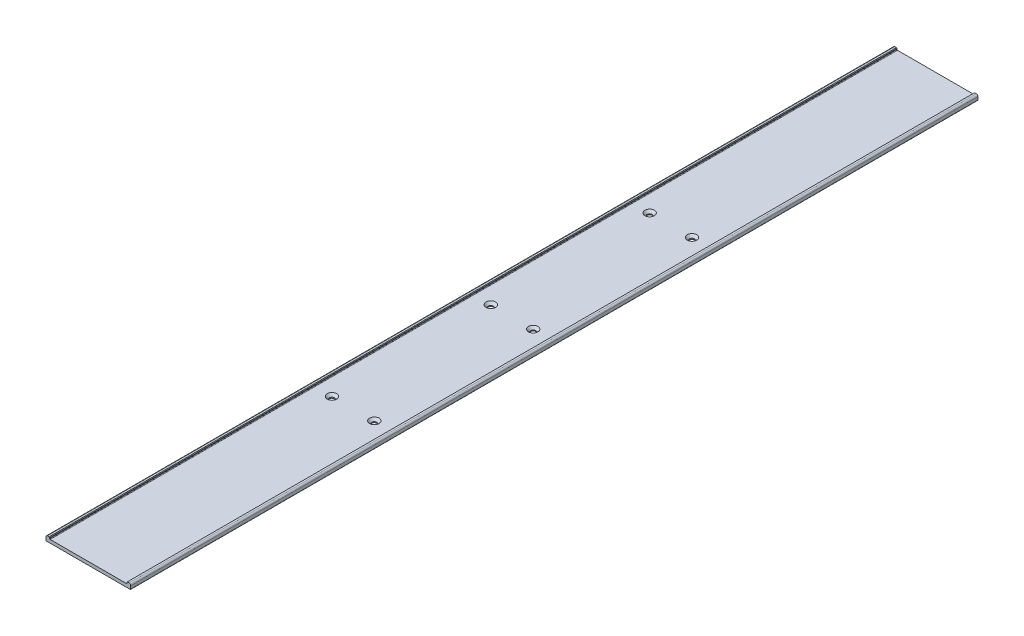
ISO-10303-21;
HEADER;
FILE_DESCRIPTION(('STEP AP214'),'2;1');
FILE_NAME('part.step','',(''),(''),'','','');
FILE_SCHEMA(('AUTOMOTIVE_DESIGN { 1 0 10303 214 1 1 1 1 }'));
ENDSEC;
DATA;
#1=APPLICATION_CONTEXT('core data for automotive mechanical design processes');
#2=APPLICATION_PROTOCOL_DEFINITION('international standard','automotive_design',2000,#1);
#3=PRODUCT_CONTEXT('',#1,'mechanical');
#4=PRODUCT('Part','Part','',(#3));
#5=PRODUCT_RELATED_PRODUCT_CATEGORY('part','',(#4));
#6=PRODUCT_DEFINITION_FORMATION('','',#4);
#7=PRODUCT_DEFINITION_CONTEXT('part definition',#1,'design');
#8=PRODUCT_DEFINITION('design','',#6,#7);
#9=PRODUCT_DEFINITION_SHAPE('','',#8);
#10=(LENGTH_UNIT() NAMED_UNIT(*) SI_UNIT(.MILLI.,.METRE.));
#11=(NAMED_UNIT(*) PLANE_ANGLE_UNIT() SI_UNIT($,.RADIAN.));
#12=(NAMED_UNIT(*) SI_UNIT($,.STERADIAN.) SOLID_ANGLE_UNIT());
#13=UNCERTAINTY_MEASURE_WITH_UNIT(LENGTH_MEASURE(1.E-05),#10,'distance_accuracy_value','');
#14=(GEOMETRIC_REPRESENTATION_CONTEXT(3) GLOBAL_UNCERTAINTY_ASSIGNED_CONTEXT((#13)) GLOBAL_UNIT_ASSIGNED_CONTEXT((#10,
#11,#12)) REPRESENTATION_CONTEXT('',''));
#15=CARTESIAN_POINT('',(0.,0.,0.));
#16=DIRECTION('',(0.,0.,1.));
#17=DIRECTION('',(1.,0.,0.));
#18=AXIS2_PLACEMENT_3D('',#15,#16,#17);
#19=CARTESIAN_POINT('',(79.5,0.5,-400.));
#20=DIRECTION('',(0.,0.,1.));
#21=DIRECTION('',(1.,0.,0.));
#22=AXIS2_PLACEMENT_3D('',#19,#20,#21);
#23=CYLINDRICAL_SURFACE('',#22,0.5);
#24=CARTESIAN_POINT('',(79.5,0.5,400.));
#25=DIRECTION('',(0.,0.,1.));
#26=DIRECTION('',(1.,0.,0.));
#27=AXIS2_PLACEMENT_3D('',#24,#25,#26);
#28=CIRCLE('',#27,0.5);
#29=CARTESIAN_POINT('',(79.5,0.,400.));
#30=VERTEX_POINT('',#29);
#31=CARTESIAN_POINT('',(80.,0.5,400.));
#32=VERTEX_POINT('',#31);
#33=EDGE_CURVE('E187',#30,#32,#28,.T.);
#34=ORIENTED_EDGE('',*,*,#33,.F.);
#35=DIRECTION('',(0.,0.,1.));
#36=VECTOR('',#35,1.);
#37=CARTESIAN_POINT('',(79.5,0.,-400.));
#38=LINE('',#37,#36);
#39=CARTESIAN_POINT('',(79.5,0.,-400.));
#40=VERTEX_POINT('',#39);
#41=EDGE_CURVE('E11',#40,#30,#38,.T.);
#42=ORIENTED_EDGE('',*,*,#41,.F.);
#43=CARTESIAN_POINT('',(79.5,0.5,-400.));
#44=DIRECTION('',(0.,0.,1.));
#45=DIRECTION('',(1.,0.,0.));
#46=AXIS2_PLACEMENT_3D('',#43,#44,#45);
#47=CIRCLE('',#46,0.5);
#48=CARTESIAN_POINT('',(80.,0.5,-400.));
#49=VERTEX_POINT('',#48);
#50=EDGE_CURVE('E232',#40,#49,#47,.T.);
#51=ORIENTED_EDGE('',*,*,#50,.T.);
#52=DIRECTION('',(0.,0.,1.));
#53=VECTOR('',#52,1.);
#54=CARTESIAN_POINT('',(80.,0.5,-400.));
#55=LINE('',#54,#53);
#56=EDGE_CURVE('E121',#49,#32,#55,.T.);
#57=ORIENTED_EDGE('',*,*,#56,.T.);
#58=EDGE_LOOP('',(#34,#42,#51,#57));
#59=FACE_BOUND('',#58,.T.);
#60=ADVANCED_FACE('F41',(#59),#23,.T.);
#61=CARTESIAN_POINT('',(0.500000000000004,0.,-400.));
#62=DIRECTION('',(0.,-1.,0.));
#63=DIRECTION('',(0.,0.,-1.));
#64=AXIS2_PLACEMENT_3D('',#61,#62,#63);
#65=PLANE('',#64);
#66=CARTESIAN_POINT('',(60.,0.,-150.));
#67=DIRECTION('',(0.,-1.,0.));
#68=DIRECTION('',(0.,0.,-1.));
#69=AXIS2_PLACEMENT_3D('',#66,#67,#68);
#70=CIRCLE('',#69,2.24999999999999);
#71=CARTESIAN_POINT('',(60.,0.,-152.25));
#72=VERTEX_POINT('',#71);
#73=EDGE_CURVE('E44',#72,#72,#70,.T.);
#74=ORIENTED_EDGE('',*,*,#73,.F.);
#75=EDGE_LOOP('',(#74));
#76=FACE_BOUND('',#75,.T.);
#77=CARTESIAN_POINT('',(60.,0.,150.));
#78=DIRECTION('',(0.,-1.,0.));
#79=DIRECTION('',(0.,0.,-1.));
#80=AXIS2_PLACEMENT_3D('',#77,#78,#79);
#81=CIRCLE('',#80,2.24999999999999);
#82=CARTESIAN_POINT('',(60.,0.,147.75));
#83=VERTEX_POINT('',#82);
#84=EDGE_CURVE('E276',#83,#83,#81,.T.);
#85=ORIENTED_EDGE('',*,*,#84,.F.);
#86=EDGE_LOOP('',(#85));
#87=FACE_BOUND('',#86,.T.);
#88=CARTESIAN_POINT('',(60.,0.,0.));
#89=DIRECTION('',(0.,-1.,0.));
#90=DIRECTION('',(0.,0.,-1.));
#91=AXIS2_PLACEMENT_3D('',#88,#89,#90);
#92=CIRCLE('',#91,2.24999999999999);
#93=CARTESIAN_POINT('',(60.,0.,-2.24999999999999));
#94=VERTEX_POINT('',#93);
#95=EDGE_CURVE('E272',#94,#94,#92,.T.);
#96=ORIENTED_EDGE('',*,*,#95,.F.);
#97=EDGE_LOOP('',(#96));
#98=FACE_BOUND('',#97,.T.);
#99=CARTESIAN_POINT('',(20.,0.,-150.));
#100=DIRECTION('',(0.,-1.,0.));
#101=DIRECTION('',(0.,0.,-1.));
#102=AXIS2_PLACEMENT_3D('',#99,#100,#101);
#103=CIRCLE('',#102,2.24999999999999);
#104=CARTESIAN_POINT('',(20.,0.,-152.25));
#105=VERTEX_POINT('',#104);
#106=EDGE_CURVE('E267',#105,#105,#103,.T.);
#107=ORIENTED_EDGE('',*,*,#106,.F.);
#108=EDGE_LOOP('',(#107));
#109=FACE_BOUND('',#108,.T.);
#110=CARTESIAN_POINT('',(20.,0.,150.));
#111=DIRECTION('',(0.,-1.,0.));
#112=DIRECTION('',(0.,0.,-1.));
#113=AXIS2_PLACEMENT_3D('',#110,#111,#112);
#114=CIRCLE('',#113,2.24999999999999);
#115=CARTESIAN_POINT('',(20.,0.,147.75));
#116=VERTEX_POINT('',#115);
#117=EDGE_CURVE('E262',#116,#116,#114,.T.);
#118=ORIENTED_EDGE('',*,*,#117,.F.);
#119=EDGE_LOOP('',(#118));
#120=FACE_BOUND('',#119,.T.);
#121=CARTESIAN_POINT('',(20.,0.,0.));
#122=DIRECTION('',(0.,-1.,0.));
#123=DIRECTION('',(0.,0.,-1.));
#124=AXIS2_PLACEMENT_3D('',#121,#122,#123);
#125=CIRCLE('',#124,2.24999999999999);
#126=CARTESIAN_POINT('',(20.,0.,-2.24999999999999));
#127=VERTEX_POINT('',#126);
#128=EDGE_CURVE('E191',#127,#127,#125,.T.);
#129=ORIENTED_EDGE('',*,*,#128,.F.);
#130=EDGE_LOOP('',(#129));
#131=FACE_BOUND('',#130,.T.);
#132=DIRECTION('',(1.,0.,0.));
#133=VECTOR('',#132,1.);
#134=CARTESIAN_POINT('',(0.500000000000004,0.,400.));
#135=LINE('',#134,#133);
#136=CARTESIAN_POINT('',(0.500000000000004,0.,400.));
#137=VERTEX_POINT('',#136);
#138=EDGE_CURVE('E230',#137,#30,#135,.T.);
#139=ORIENTED_EDGE('',*,*,#138,.F.);
#140=DIRECTION('',(0.,0.,1.));
#141=VECTOR('',#140,1.);
#142=CARTESIAN_POINT('',(0.500000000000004,0.,-400.));
#143=LINE('',#142,#141);
#144=CARTESIAN_POINT('',(0.500000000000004,0.,-400.));
#145=VERTEX_POINT('',#144);
#146=EDGE_CURVE('E50',#145,#137,#143,.T.);
#147=ORIENTED_EDGE('',*,*,#146,.F.);
#148=DIRECTION('',(1.,0.,0.));
#149=VECTOR('',#148,1.);
#150=CARTESIAN_POINT('',(0.500000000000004,0.,-400.));
#151=LINE('',#150,#149);
#152=EDGE_CURVE('E177',#145,#40,#151,.T.);
#153=ORIENTED_EDGE('',*,*,#152,.T.);
#154=ORIENTED_EDGE('',*,*,#41,.T.);
#155=EDGE_LOOP('',(#139,#147,#153,#154));
#156=FACE_BOUND('',#155,.T.);
#157=ADVANCED_FACE('F381',(#76,#87,#98,#109,#120,#131,#156),#65,.T.);
#158=CARTESIAN_POINT('',(0.5,0.5,-400.));
#159=DIRECTION('',(0.,0.,1.));
#160=DIRECTION('',(1.,0.,0.));
#161=AXIS2_PLACEMENT_3D('',#158,#159,#160);
#162=CYLINDRICAL_SURFACE('',#161,0.5);
#163=CARTESIAN_POINT('',(0.5,0.5,400.));
#164=DIRECTION('',(0.,0.,1.));
#165=DIRECTION('',(1.,0.,0.));
#166=AXIS2_PLACEMENT_3D('',#163,#164,#165);
#167=CIRCLE('',#166,0.5);
#168=CARTESIAN_POINT('',(0.,0.500000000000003,400.));
#169=VERTEX_POINT('',#168);
#170=EDGE_CURVE('E164',#169,#137,#167,.T.);
#171=ORIENTED_EDGE('',*,*,#170,.F.);
#172=DIRECTION('',(0.,0.,1.));
#173=VECTOR('',#172,1.);
#174=CARTESIAN_POINT('',(0.,0.500000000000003,-400.));
#175=LINE('',#174,#173);
#176=CARTESIAN_POINT('',(0.,0.500000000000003,-400.));
#177=VERTEX_POINT('',#176);
#178=EDGE_CURVE('E159',#177,#169,#175,.T.);
#179=ORIENTED_EDGE('',*,*,#178,.F.);
#180=CARTESIAN_POINT('',(0.5,0.5,-400.));
#181=DIRECTION('',(0.,0.,1.));
#182=DIRECTION('',(1.,0.,0.));
#183=AXIS2_PLACEMENT_3D('',#180,#181,#182);
#184=CIRCLE('',#183,0.5);
#185=EDGE_CURVE('E162',#177,#145,#184,.T.);
#186=ORIENTED_EDGE('',*,*,#185,.T.);
#187=ORIENTED_EDGE('',*,*,#146,.T.);
#188=EDGE_LOOP('',(#171,#179,#186,#187));
#189=FACE_BOUND('',#188,.T.);
#190=ADVANCED_FACE('F161',(#189),#162,.T.);
#191=CARTESIAN_POINT('',(0.,0.500000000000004,-400.));
#192=DIRECTION('',(-1.,0.,0.));
#193=DIRECTION('',(0.,0.,1.));
#194=AXIS2_PLACEMENT_3D('',#191,#192,#193);
#195=PLANE('',#194);
#196=DIRECTION('',(0.,-1.,0.));
#197=VECTOR('',#196,1.);
#198=CARTESIAN_POINT('',(0.,0.500000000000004,400.));
#199=LINE('',#198,#197);
#200=CARTESIAN_POINT('',(0.,3.3,400.));
#201=VERTEX_POINT('',#200);
#202=EDGE_CURVE('E227',#201,#169,#199,.T.);
#203=ORIENTED_EDGE('',*,*,#202,.F.);
#204=DIRECTION('',(0.,0.,1.));
#205=VECTOR('',#204,1.);
#206=CARTESIAN_POINT('',(0.,3.3,-400.));
#207=LINE('',#206,#205);
#208=CARTESIAN_POINT('',(0.,3.3,-400.));
#209=VERTEX_POINT('',#208);
#210=EDGE_CURVE('E169',#209,#201,#207,.T.);
#211=ORIENTED_EDGE('',*,*,#210,.F.);
#212=DIRECTION('',(0.,-1.,0.));
#213=VECTOR('',#212,1.);
#214=CARTESIAN_POINT('',(0.,0.500000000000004,-400.));
#215=LINE('',#214,#213);
#216=EDGE_CURVE('E175',#209,#177,#215,.T.);
#217=ORIENTED_EDGE('',*,*,#216,.T.);
#218=ORIENTED_EDGE('',*,*,#178,.T.);
#219=EDGE_LOOP('',(#203,#211,#217,#218));
#220=FACE_BOUND('',#219,.T.);
#221=ADVANCED_FACE('F179',(#220),#195,.T.);
#222=CARTESIAN_POINT('',(1.5,3.3,-400.));
#223=DIRECTION('',(0.,0.,1.));
#224=DIRECTION('',(1.,0.,0.));
#225=AXIS2_PLACEMENT_3D('',#222,#223,#224);
#226=CYLINDRICAL_SURFACE('',#225,1.5);
#227=CARTESIAN_POINT('',(1.5,3.3,400.));
#228=DIRECTION('',(0.,0.,1.));
#229=DIRECTION('',(-1.,0.,0.));
#230=AXIS2_PLACEMENT_3D('',#227,#228,#229);
#231=CIRCLE('',#230,1.5);
#232=CARTESIAN_POINT('',(1.5,4.8,400.));
#233=VERTEX_POINT('',#232);
#234=EDGE_CURVE('E224',#233,#201,#231,.T.);
#235=ORIENTED_EDGE('',*,*,#234,.F.);
#236=DIRECTION('',(0.,0.,1.));
#237=VECTOR('',#236,1.);
#238=CARTESIAN_POINT('',(1.5,4.8,-400.));
#239=LINE('',#238,#237);
#240=CARTESIAN_POINT('',(1.5,4.8,-400.));
#241=VERTEX_POINT('',#240);
#242=EDGE_CURVE('E236',#241,#233,#239,.T.);
#243=ORIENTED_EDGE('',*,*,#242,.F.);
#244=CARTESIAN_POINT('',(1.5,3.3,-400.));
#245=DIRECTION('',(0.,0.,1.));
#246=DIRECTION('',(-1.,0.,0.));
#247=AXIS2_PLACEMENT_3D('',#244,#245,#246);
#248=CIRCLE('',#247,1.5);
#249=EDGE_CURVE('E180',#241,#209,#248,.T.);
#250=ORIENTED_EDGE('',*,*,#249,.T.);
#251=ORIENTED_EDGE('',*,*,#210,.T.);
#252=EDGE_LOOP('',(#235,#243,#250,#251));
#253=FACE_BOUND('',#252,.T.);
#254=ADVANCED_FACE('F399',(#253),#226,.T.);
#255=CARTESIAN_POINT('',(1.5,4.8,-400.));
#256=DIRECTION('',(0.,1.,0.));
#257=DIRECTION('',(-1.,0.,0.));
#258=AXIS2_PLACEMENT_3D('',#255,#256,#257);
#259=PLANE('',#258);
#260=DIRECTION('',(-1.,0.,0.));
#261=VECTOR('',#260,1.);
#262=CARTESIAN_POINT('',(1.5,4.8,400.));
#263=LINE('',#262,#261);
#264=CARTESIAN_POINT('',(3.,4.8,400.));
#265=VERTEX_POINT('',#264);
#266=EDGE_CURVE('E221',#265,#233,#263,.T.);
#267=ORIENTED_EDGE('',*,*,#266,.F.);
#268=DIRECTION('',(0.,0.,1.));
#269=VECTOR('',#268,1.);
#270=CARTESIAN_POINT('',(3.,4.8,-400.));
#271=LINE('',#270,#269);
#272=CARTESIAN_POINT('',(3.,4.8,-400.));
#273=VERTEX_POINT('',#272);
#274=EDGE_CURVE('E238',#273,#265,#271,.T.);
#275=ORIENTED_EDGE('',*,*,#274,.F.);
#276=DIRECTION('',(-1.,0.,0.));
#277=VECTOR('',#276,1.);
#278=CARTESIAN_POINT('',(1.5,4.8,-400.));
#279=LINE('',#278,#277);
#280=EDGE_CURVE('E182',#273,#241,#279,.T.);
#281=ORIENTED_EDGE('',*,*,#280,.T.);
#282=ORIENTED_EDGE('',*,*,#242,.T.);
#283=EDGE_LOOP('',(#267,#275,#281,#282));
#284=FACE_BOUND('',#283,.T.);
#285=ADVANCED_FACE('F340',(#284),#259,.T.);
#286=CARTESIAN_POINT('',(3.,4.8,-400.));
#287=DIRECTION('',(0.707106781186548,0.707106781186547,0.));
#288=DIRECTION('',(-0.707106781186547,0.707106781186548,0.));
#289=AXIS2_PLACEMENT_3D('',#286,#287,#288);
#290=PLANE('',#289);
#291=DIRECTION('',(-0.707106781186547,0.707106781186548,0.));
#292=VECTOR('',#291,1.);
#293=CARTESIAN_POINT('',(3.,4.8,400.));
#294=LINE('',#293,#292);
#295=CARTESIAN_POINT('',(3.5,4.3,400.));
#296=VERTEX_POINT('',#295);
#297=EDGE_CURVE('E218',#296,#265,#294,.T.);
#298=ORIENTED_EDGE('',*,*,#297,.F.);
#299=DIRECTION('',(0.,0.,1.));
#300=VECTOR('',#299,1.);
#301=CARTESIAN_POINT('',(3.5,4.3,-400.));
#302=LINE('',#301,#300);
#303=CARTESIAN_POINT('',(3.5,4.3,-400.));
#304=VERTEX_POINT('',#303);
#305=EDGE_CURVE('E240',#304,#296,#302,.T.);
#306=ORIENTED_EDGE('',*,*,#305,.F.);
#307=DIRECTION('',(-0.707106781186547,0.707106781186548,0.));
#308=VECTOR('',#307,1.);
#309=CARTESIAN_POINT('',(3.,4.8,-400.));
#310=LINE('',#309,#308);
#311=EDGE_CURVE('E334',#304,#273,#310,.T.);
#312=ORIENTED_EDGE('',*,*,#311,.T.);
#313=ORIENTED_EDGE('',*,*,#274,.T.);
#314=EDGE_LOOP('',(#298,#306,#312,#313));
#315=FACE_BOUND('',#314,.T.);
#316=ADVANCED_FACE('F346',(#315),#290,.T.);
#317=CARTESIAN_POINT('',(3.5,4.3,-400.));
#318=DIRECTION('',(1.,0.,0.));
#319=DIRECTION('',(0.,1.,0.));
#320=AXIS2_PLACEMENT_3D('',#317,#318,#319);
#321=PLANE('',#320);
#322=DIRECTION('',(0.,1.,0.));
#323=VECTOR('',#322,1.);
#324=CARTESIAN_POINT('',(3.5,4.3,400.));
#325=LINE('',#324,#323);
#326=CARTESIAN_POINT('',(3.5,3.6,400.));
#327=VERTEX_POINT('',#326);
#328=EDGE_CURVE('E215',#327,#296,#325,.T.);
#329=ORIENTED_EDGE('',*,*,#328,.F.);
#330=DIRECTION('',(0.,0.,1.));
#331=VECTOR('',#330,1.);
#332=CARTESIAN_POINT('',(3.5,3.6,-400.));
#333=LINE('',#332,#331);
#334=CARTESIAN_POINT('',(3.5,3.6,-400.));
#335=VERTEX_POINT('',#334);
#336=EDGE_CURVE('E242',#335,#327,#333,.T.);
#337=ORIENTED_EDGE('',*,*,#336,.F.);
#338=DIRECTION('',(0.,1.,0.));
#339=VECTOR('',#338,1.);
#340=CARTESIAN_POINT('',(3.5,4.3,-400.));
#341=LINE('',#340,#339);
#342=EDGE_CURVE('E331',#335,#304,#341,.T.);
#343=ORIENTED_EDGE('',*,*,#342,.T.);
#344=ORIENTED_EDGE('',*,*,#305,.T.);
#345=EDGE_LOOP('',(#329,#337,#343,#344));
#346=FACE_BOUND('',#345,.T.);
#347=ADVANCED_FACE('F349',(#346),#321,.T.);
#348=CARTESIAN_POINT('',(4.,3.6,-400.));
#349=DIRECTION('',(0.,0.,1.));
#350=DIRECTION('',(1.,0.,0.));
#351=AXIS2_PLACEMENT_3D('',#348,#349,#350);
#352=CYLINDRICAL_SURFACE('',#351,0.5);
#353=CARTESIAN_POINT('',(4.,3.6,400.));
#354=DIRECTION('',(0.,0.,-1.));
#355=DIRECTION('',(1.,0.,0.));
#356=AXIS2_PLACEMENT_3D('',#353,#354,#355);
#357=CIRCLE('',#356,0.5);
#358=CARTESIAN_POINT('',(4.,3.1,400.));
#359=VERTEX_POINT('',#358);
#360=EDGE_CURVE('E212',#359,#327,#357,.T.);
#361=ORIENTED_EDGE('',*,*,#360,.F.);
#362=DIRECTION('',(0.,0.,1.));
#363=VECTOR('',#362,1.);
#364=CARTESIAN_POINT('',(4.,3.1,-400.));
#365=LINE('',#364,#363);
#366=CARTESIAN_POINT('',(4.,3.1,-400.));
#367=VERTEX_POINT('',#366);
#368=EDGE_CURVE('E244',#367,#359,#365,.T.);
#369=ORIENTED_EDGE('',*,*,#368,.F.);
#370=CARTESIAN_POINT('',(4.,3.6,-400.));
#371=DIRECTION('',(0.,0.,-1.));
#372=DIRECTION('',(1.,0.,0.));
#373=AXIS2_PLACEMENT_3D('',#370,#371,#372);
#374=CIRCLE('',#373,0.5);
#375=EDGE_CURVE('E328',#367,#335,#374,.T.);
#376=ORIENTED_EDGE('',*,*,#375,.T.);
#377=ORIENTED_EDGE('',*,*,#336,.T.);
#378=EDGE_LOOP('',(#361,#369,#376,#377));
#379=FACE_BOUND('',#378,.T.);
#380=ADVANCED_FACE('F354',(#379),#352,.F.);
#381=CARTESIAN_POINT('',(4.,3.1,-400.));
#382=DIRECTION('',(0.,1.,0.));
#383=DIRECTION('',(-1.,0.,0.));
#384=AXIS2_PLACEMENT_3D('',#381,#382,#383);
#385=PLANE('',#384);
#386=CARTESIAN_POINT('',(60.,3.1,-150.));
#387=DIRECTION('',(0.,1.,0.));
#388=DIRECTION('',(0.,0.,1.));
#389=AXIS2_PLACEMENT_3D('',#386,#387,#388);
#390=CIRCLE('',#389,4.48);
#391=CARTESIAN_POINT('',(60.,3.1,-145.52));
#392=VERTEX_POINT('',#391);
#393=EDGE_CURVE('E483',#392,#392,#390,.T.);
#394=ORIENTED_EDGE('',*,*,#393,.F.);
#395=EDGE_LOOP('',(#394));
#396=FACE_BOUND('',#395,.T.);
#397=CARTESIAN_POINT('',(60.,3.1,150.));
#398=DIRECTION('',(0.,1.,0.));
#399=DIRECTION('',(0.,0.,1.));
#400=AXIS2_PLACEMENT_3D('',#397,#398,#399);
#401=CIRCLE('',#400,4.48);
#402=CARTESIAN_POINT('',(60.,3.1,154.48));
#403=VERTEX_POINT('',#402);
#404=EDGE_CURVE('E285',#403,#403,#401,.T.);
#405=ORIENTED_EDGE('',*,*,#404,.F.);
#406=EDGE_LOOP('',(#405));
#407=FACE_BOUND('',#406,.T.);
#408=CARTESIAN_POINT('',(60.,3.1,0.));
#409=DIRECTION('',(0.,1.,0.));
#410=DIRECTION('',(0.,0.,1.));
#411=AXIS2_PLACEMENT_3D('',#408,#409,#410);
#412=CIRCLE('',#411,4.48);
#413=CARTESIAN_POINT('',(60.,3.1,4.48));
#414=VERTEX_POINT('',#413);
#415=EDGE_CURVE('E278',#414,#414,#412,.T.);
#416=ORIENTED_EDGE('',*,*,#415,.F.);
#417=EDGE_LOOP('',(#416));
#418=FACE_BOUND('',#417,.T.);
#419=CARTESIAN_POINT('',(20.,3.1,-150.));
#420=DIRECTION('',(0.,1.,0.));
#421=DIRECTION('',(0.,0.,1.));
#422=AXIS2_PLACEMENT_3D('',#419,#420,#421);
#423=CIRCLE('',#422,4.48);
#424=CARTESIAN_POINT('',(20.,3.1,-145.52));
#425=VERTEX_POINT('',#424);
#426=EDGE_CURVE('E274',#425,#425,#423,.T.);
#427=ORIENTED_EDGE('',*,*,#426,.F.);
#428=EDGE_LOOP('',(#427));
#429=FACE_BOUND('',#428,.T.);
#430=CARTESIAN_POINT('',(20.,3.1,150.));
#431=DIRECTION('',(0.,1.,0.));
#432=DIRECTION('',(0.,0.,1.));
#433=AXIS2_PLACEMENT_3D('',#430,#431,#432);
#434=CIRCLE('',#433,4.48);
#435=CARTESIAN_POINT('',(20.,3.1,154.48));
#436=VERTEX_POINT('',#435);
#437=EDGE_CURVE('E270',#436,#436,#434,.T.);
#438=ORIENTED_EDGE('',*,*,#437,.F.);
#439=EDGE_LOOP('',(#438));
#440=FACE_BOUND('',#439,.T.);
#441=CARTESIAN_POINT('',(20.,3.1,0.));
#442=DIRECTION('',(0.,1.,0.));
#443=DIRECTION('',(0.,0.,1.));
#444=AXIS2_PLACEMENT_3D('',#441,#442,#443);
#445=CIRCLE('',#444,4.48);
#446=CARTESIAN_POINT('',(20.,3.1,4.48));
#447=VERTEX_POINT('',#446);
#448=EDGE_CURVE('E265',#447,#447,#445,.T.);
#449=ORIENTED_EDGE('',*,*,#448,.F.);
#450=EDGE_LOOP('',(#449));
#451=FACE_BOUND('',#450,.T.);
#452=DIRECTION('',(-1.,0.,0.));
#453=VECTOR('',#452,1.);
#454=CARTESIAN_POINT('',(4.,3.1,400.));
#455=LINE('',#454,#453);
#456=CARTESIAN_POINT('',(76.,3.1,400.));
#457=VERTEX_POINT('',#456);
#458=EDGE_CURVE('E209',#457,#359,#455,.T.);
#459=ORIENTED_EDGE('',*,*,#458,.F.);
#460=DIRECTION('',(0.,0.,1.));
#461=VECTOR('',#460,1.);
#462=CARTESIAN_POINT('',(76.,3.1,-400.));
#463=LINE('',#462,#461);
#464=CARTESIAN_POINT('',(76.,3.1,-400.));
#465=VERTEX_POINT('',#464);
#466=EDGE_CURVE('E246',#465,#457,#463,.T.);
#467=ORIENTED_EDGE('',*,*,#466,.F.);
#468=DIRECTION('',(-1.,0.,0.));
#469=VECTOR('',#468,1.);
#470=CARTESIAN_POINT('',(4.,3.1,-400.));
#471=LINE('',#470,#469);
#472=EDGE_CURVE('E325',#465,#367,#471,.T.);
#473=ORIENTED_EDGE('',*,*,#472,.T.);
#474=ORIENTED_EDGE('',*,*,#368,.T.);
#475=EDGE_LOOP('',(#459,#467,#473,#474));
#476=FACE_BOUND('',#475,.T.);
#477=ADVANCED_FACE('F357',(#396,#407,#418,#429,#440,#451,#476),#385,.T.);
#478=CARTESIAN_POINT('',(76.,3.6,-400.));
#479=DIRECTION('',(0.,0.,1.));
#480=DIRECTION('',(1.,0.,0.));
#481=AXIS2_PLACEMENT_3D('',#478,#479,#480);
#482=CYLINDRICAL_SURFACE('',#481,0.5);
#483=CARTESIAN_POINT('',(76.,3.6,400.));
#484=DIRECTION('',(0.,0.,-1.));
#485=DIRECTION('',(-1.,0.,0.));
#486=AXIS2_PLACEMENT_3D('',#483,#484,#485);
#487=CIRCLE('',#486,0.5);
#488=CARTESIAN_POINT('',(76.5,3.6,400.));
#489=VERTEX_POINT('',#488);
#490=EDGE_CURVE('E206',#489,#457,#487,.T.);
#491=ORIENTED_EDGE('',*,*,#490,.F.);
#492=DIRECTION('',(0.,0.,1.));
#493=VECTOR('',#492,1.);
#494=CARTESIAN_POINT('',(76.5,3.6,-400.));
#495=LINE('',#494,#493);
#496=CARTESIAN_POINT('',(76.5,3.6,-400.));
#497=VERTEX_POINT('',#496);
#498=EDGE_CURVE('E248',#497,#489,#495,.T.);
#499=ORIENTED_EDGE('',*,*,#498,.F.);
#500=CARTESIAN_POINT('',(76.,3.6,-400.));
#501=DIRECTION('',(0.,0.,-1.));
#502=DIRECTION('',(-1.,0.,0.));
#503=AXIS2_PLACEMENT_3D('',#500,#501,#502);
#504=CIRCLE('',#503,0.5);
#505=EDGE_CURVE('E322',#497,#465,#504,.T.);
#506=ORIENTED_EDGE('',*,*,#505,.T.);
#507=ORIENTED_EDGE('',*,*,#466,.T.);
#508=EDGE_LOOP('',(#491,#499,#506,#507));
#509=FACE_BOUND('',#508,.T.);
#510=ADVANCED_FACE('F362',(#509),#482,.F.);
#511=CARTESIAN_POINT('',(76.5,4.55,-400.));
#512=DIRECTION('',(-1.,0.,0.));
#513=DIRECTION('',(0.,0.,1.));
#514=AXIS2_PLACEMENT_3D('',#511,#512,#513);
#515=PLANE('',#514);
#516=DIRECTION('',(0.,-1.,0.));
#517=VECTOR('',#516,1.);
#518=CARTESIAN_POINT('',(76.5,4.55,400.));
#519=LINE('',#518,#517);
#520=CARTESIAN_POINT('',(76.5,4.55,400.));
#521=VERTEX_POINT('',#520);
#522=EDGE_CURVE('E203',#521,#489,#519,.T.);
#523=ORIENTED_EDGE('',*,*,#522,.F.);
#524=DIRECTION('',(0.,0.,1.));
#525=VECTOR('',#524,1.);
#526=CARTESIAN_POINT('',(76.5,4.55,-400.));
#527=LINE('',#526,#525);
#528=CARTESIAN_POINT('',(76.5,4.55,-400.));
#529=VERTEX_POINT('',#528);
#530=EDGE_CURVE('E250',#529,#521,#527,.T.);
#531=ORIENTED_EDGE('',*,*,#530,.F.);
#532=DIRECTION('',(0.,-1.,0.));
#533=VECTOR('',#532,1.);
#534=CARTESIAN_POINT('',(76.5,4.55,-400.));
#535=LINE('',#534,#533);
#536=EDGE_CURVE('E319',#529,#497,#535,.T.);
#537=ORIENTED_EDGE('',*,*,#536,.T.);
#538=ORIENTED_EDGE('',*,*,#498,.T.);
#539=EDGE_LOOP('',(#523,#531,#537,#538));
#540=FACE_BOUND('',#539,.T.);
#541=ADVANCED_FACE('F365',(#540),#515,.T.);
#542=CARTESIAN_POINT('',(76.75,4.8,-400.));
#543=DIRECTION('',(-0.707106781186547,0.707106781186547,0.));
#544=DIRECTION('',(-0.707106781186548,-0.707106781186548,0.));
#545=AXIS2_PLACEMENT_3D('',#542,#543,#544);
#546=PLANE('',#545);
#547=DIRECTION('',(-0.707106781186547,-0.707106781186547,0.));
#548=VECTOR('',#547,1.);
#549=CARTESIAN_POINT('',(76.75,4.8,400.));
#550=LINE('',#549,#548);
#551=CARTESIAN_POINT('',(76.75,4.8,400.));
#552=VERTEX_POINT('',#551);
#553=EDGE_CURVE('E200',#552,#521,#550,.T.);
#554=ORIENTED_EDGE('',*,*,#553,.F.);
#555=DIRECTION('',(0.,0.,1.));
#556=VECTOR('',#555,1.);
#557=CARTESIAN_POINT('',(76.75,4.8,-400.));
#558=LINE('',#557,#556);
#559=CARTESIAN_POINT('',(76.75,4.8,-400.));
#560=VERTEX_POINT('',#559);
#561=EDGE_CURVE('E252',#560,#552,#558,.T.);
#562=ORIENTED_EDGE('',*,*,#561,.F.);
#563=DIRECTION('',(-0.707106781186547,-0.707106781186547,0.));
#564=VECTOR('',#563,1.);
#565=CARTESIAN_POINT('',(76.75,4.8,-400.));
#566=LINE('',#565,#564);
#567=EDGE_CURVE('E316',#560,#529,#566,.T.);
#568=ORIENTED_EDGE('',*,*,#567,.T.);
#569=ORIENTED_EDGE('',*,*,#530,.T.);
#570=EDGE_LOOP('',(#554,#562,#568,#569));
#571=FACE_BOUND('',#570,.T.);
#572=ADVANCED_FACE('F370',(#571),#546,.T.);
#573=CARTESIAN_POINT('',(76.75,4.8,-400.));
#574=DIRECTION('',(0.,1.,0.));
#575=DIRECTION('',(0.,0.,1.));
#576=AXIS2_PLACEMENT_3D('',#573,#574,#575);
#577=PLANE('',#576);
#578=DIRECTION('',(-1.,0.,0.));
#579=VECTOR('',#578,1.);
#580=CARTESIAN_POINT('',(76.75,4.8,400.));
#581=LINE('',#580,#579);
#582=CARTESIAN_POINT('',(78.5,4.8,400.));
#583=VERTEX_POINT('',#582);
#584=EDGE_CURVE('E197',#583,#552,#581,.T.);
#585=ORIENTED_EDGE('',*,*,#584,.F.);
#586=DIRECTION('',(0.,0.,1.));
#587=VECTOR('',#586,1.);
#588=CARTESIAN_POINT('',(78.5,4.8,-400.));
#589=LINE('',#588,#587);
#590=CARTESIAN_POINT('',(78.5,4.8,-400.));
#591=VERTEX_POINT('',#590);
#592=EDGE_CURVE('E254',#591,#583,#589,.T.);
#593=ORIENTED_EDGE('',*,*,#592,.F.);
#594=DIRECTION('',(-1.,0.,0.));
#595=VECTOR('',#594,1.);
#596=CARTESIAN_POINT('',(76.75,4.8,-400.));
#597=LINE('',#596,#595);
#598=EDGE_CURVE('E313',#591,#560,#597,.T.);
#599=ORIENTED_EDGE('',*,*,#598,.T.);
#600=ORIENTED_EDGE('',*,*,#561,.T.);
#601=EDGE_LOOP('',(#585,#593,#599,#600));
#602=FACE_BOUND('',#601,.T.);
#603=ADVANCED_FACE('F373',(#602),#577,.T.);
#604=CARTESIAN_POINT('',(78.5,3.3,-400.));
#605=DIRECTION('',(0.,0.,1.));
#606=DIRECTION('',(1.,0.,0.));
#607=AXIS2_PLACEMENT_3D('',#604,#605,#606);
#608=CYLINDRICAL_SURFACE('',#607,1.5);
#609=CARTESIAN_POINT('',(78.5,3.3,400.));
#610=DIRECTION('',(0.,0.,1.));
#611=DIRECTION('',(-1.,0.,0.));
#612=AXIS2_PLACEMENT_3D('',#609,#610,#611);
#613=CIRCLE('',#612,1.5);
#614=CARTESIAN_POINT('',(80.,3.3,400.));
#615=VERTEX_POINT('',#614);
#616=EDGE_CURVE('E194',#615,#583,#613,.T.);
#617=ORIENTED_EDGE('',*,*,#616,.F.);
#618=DIRECTION('',(0.,0.,1.));
#619=VECTOR('',#618,1.);
#620=CARTESIAN_POINT('',(80.,3.3,-400.));
#621=LINE('',#620,#619);
#622=CARTESIAN_POINT('',(80.,3.3,-400.));
#623=VERTEX_POINT('',#622);
#624=EDGE_CURVE('E256',#623,#615,#621,.T.);
#625=ORIENTED_EDGE('',*,*,#624,.F.);
#626=CARTESIAN_POINT('',(78.5,3.3,-400.));
#627=DIRECTION('',(0.,0.,1.));
#628=DIRECTION('',(-1.,0.,0.));
#629=AXIS2_PLACEMENT_3D('',#626,#627,#628);
#630=CIRCLE('',#629,1.5);
#631=EDGE_CURVE('E310',#623,#591,#630,.T.);
#632=ORIENTED_EDGE('',*,*,#631,.T.);
#633=ORIENTED_EDGE('',*,*,#592,.T.);
#634=EDGE_LOOP('',(#617,#625,#632,#633));
#635=FACE_BOUND('',#634,.T.);
#636=ADVANCED_FACE('F377',(#635),#608,.T.);
#637=CARTESIAN_POINT('',(80.,0.5,-400.));
#638=DIRECTION('',(1.,0.,0.));
#639=DIRECTION('',(0.,0.,-1.));
#640=AXIS2_PLACEMENT_3D('',#637,#638,#639);
#641=PLANE('',#640);
#642=DIRECTION('',(0.,1.,0.));
#643=VECTOR('',#642,1.);
#644=CARTESIAN_POINT('',(80.,0.5,400.));
#645=LINE('',#644,#643);
#646=EDGE_CURVE('E190',#32,#615,#645,.T.);
#647=ORIENTED_EDGE('',*,*,#646,.F.);
#648=ORIENTED_EDGE('',*,*,#56,.F.);
#649=DIRECTION('',(0.,1.,0.));
#650=VECTOR('',#649,1.);
#651=CARTESIAN_POINT('',(80.,0.5,-400.));
#652=LINE('',#651,#650);
#653=EDGE_CURVE('E308',#49,#623,#652,.T.);
#654=ORIENTED_EDGE('',*,*,#653,.T.);
#655=ORIENTED_EDGE('',*,*,#624,.T.);
#656=EDGE_LOOP('',(#647,#648,#654,#655));
#657=FACE_BOUND('',#656,.T.);
#658=ADVANCED_FACE('F378',(#657),#641,.T.);
#659=CARTESIAN_POINT('',(79.5,0.5,-400.));
#660=DIRECTION('',(0.,0.,1.));
#661=DIRECTION('',(1.,0.,0.));
#662=AXIS2_PLACEMENT_3D('',#659,#660,#661);
#663=PLANE('',#662);
#664=ORIENTED_EDGE('',*,*,#50,.F.);
#665=ORIENTED_EDGE('',*,*,#152,.F.);
#666=ORIENTED_EDGE('',*,*,#185,.F.);
#667=ORIENTED_EDGE('',*,*,#216,.F.);
#668=ORIENTED_EDGE('',*,*,#249,.F.);
#669=ORIENTED_EDGE('',*,*,#280,.F.);
#670=ORIENTED_EDGE('',*,*,#311,.F.);
#671=ORIENTED_EDGE('',*,*,#342,.F.);
#672=ORIENTED_EDGE('',*,*,#375,.F.);
#673=ORIENTED_EDGE('',*,*,#472,.F.);
#674=ORIENTED_EDGE('',*,*,#505,.F.);
#675=ORIENTED_EDGE('',*,*,#536,.F.);
#676=ORIENTED_EDGE('',*,*,#567,.F.);
#677=ORIENTED_EDGE('',*,*,#598,.F.);
#678=ORIENTED_EDGE('',*,*,#631,.F.);
#679=ORIENTED_EDGE('',*,*,#653,.F.);
#680=EDGE_LOOP('',(#664,#665,#666,#667,#668,#669,#670,#671,#672,#673,#674,#675,#676,#677,#678,#679));
#681=FACE_BOUND('',#680,.T.);
#682=ADVANCED_FACE('F173',(#681),#663,.F.);
#683=CARTESIAN_POINT('',(79.5,0.5,400.));
#684=DIRECTION('',(0.,0.,1.));
#685=DIRECTION('',(1.,0.,0.));
#686=AXIS2_PLACEMENT_3D('',#683,#684,#685);
#687=PLANE('',#686);
#688=ORIENTED_EDGE('',*,*,#33,.T.);
#689=ORIENTED_EDGE('',*,*,#646,.T.);
#690=ORIENTED_EDGE('',*,*,#616,.T.);
#691=ORIENTED_EDGE('',*,*,#584,.T.);
#692=ORIENTED_EDGE('',*,*,#553,.T.);
#693=ORIENTED_EDGE('',*,*,#522,.T.);
#694=ORIENTED_EDGE('',*,*,#490,.T.);
#695=ORIENTED_EDGE('',*,*,#458,.T.);
#696=ORIENTED_EDGE('',*,*,#360,.T.);
#697=ORIENTED_EDGE('',*,*,#328,.T.);
#698=ORIENTED_EDGE('',*,*,#297,.T.);
#699=ORIENTED_EDGE('',*,*,#266,.T.);
#700=ORIENTED_EDGE('',*,*,#234,.T.);
#701=ORIENTED_EDGE('',*,*,#202,.T.);
#702=ORIENTED_EDGE('',*,*,#170,.T.);
#703=ORIENTED_EDGE('',*,*,#138,.T.);
#704=EDGE_LOOP('',(#688,#689,#690,#691,#692,#693,#694,#695,#696,#697,#698,#699,#700,#701,#702,#703));
#705=FACE_BOUND('',#704,.T.);
#706=ADVANCED_FACE('F380',(#705),#687,.T.);
#707=CARTESIAN_POINT('',(20.,3.1,0.));
#708=DIRECTION('',(0.,1.,0.));
#709=DIRECTION('',(0.,0.,1.));
#710=AXIS2_PLACEMENT_3D('',#707,#708,#709);
#711=CYLINDRICAL_SURFACE('',#710,2.24999999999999);
#712=ORIENTED_EDGE('',*,*,#128,.T.);
#713=EDGE_LOOP('',(#712));
#714=FACE_BOUND('',#713,.T.);
#715=CARTESIAN_POINT('',(20.,0.869999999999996,0.));
#716=DIRECTION('',(0.,1.,0.));
#717=DIRECTION('',(0.,0.,1.));
#718=AXIS2_PLACEMENT_3D('',#715,#716,#717);
#719=CIRCLE('',#718,2.25);
#720=CARTESIAN_POINT('',(20.,0.869999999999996,2.25));
#721=VERTEX_POINT('',#720);
#722=EDGE_CURVE('E261',#721,#721,#719,.T.);
#723=ORIENTED_EDGE('',*,*,#722,.T.);
#724=EDGE_LOOP('',(#723));
#725=FACE_BOUND('',#724,.T.);
#726=ADVANCED_FACE('F429',(#714,#725),#711,.F.);
#727=CARTESIAN_POINT('',(20.,3.1,0.));
#728=DIRECTION('',(0.,1.,0.));
#729=DIRECTION('',(0.,0.,1.));
#730=AXIS2_PLACEMENT_3D('',#727,#728,#729);
#731=CONICAL_SURFACE('',#730,4.48,0.785398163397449);
#732=ORIENTED_EDGE('',*,*,#722,.F.);
#733=EDGE_LOOP('',(#732));
#734=FACE_BOUND('',#733,.T.);
#735=ORIENTED_EDGE('',*,*,#448,.T.);
#736=EDGE_LOOP('',(#735));
#737=FACE_BOUND('',#736,.T.);
#738=ADVANCED_FACE('F433',(#734,#737),#731,.F.);
#739=CARTESIAN_POINT('',(20.,3.1,150.));
#740=DIRECTION('',(0.,1.,0.));
#741=DIRECTION('',(0.,0.,1.));
#742=AXIS2_PLACEMENT_3D('',#739,#740,#741);
#743=CYLINDRICAL_SURFACE('',#742,2.24999999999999);
#744=ORIENTED_EDGE('',*,*,#117,.T.);
#745=EDGE_LOOP('',(#744));
#746=FACE_BOUND('',#745,.T.);
#747=CARTESIAN_POINT('',(20.,0.869999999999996,150.));
#748=DIRECTION('',(0.,1.,0.));
#749=DIRECTION('',(0.,0.,1.));
#750=AXIS2_PLACEMENT_3D('',#747,#748,#749);
#751=CIRCLE('',#750,2.25);
#752=CARTESIAN_POINT('',(20.,0.869999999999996,152.25));
#753=VERTEX_POINT('',#752);
#754=EDGE_CURVE('E266',#753,#753,#751,.T.);
#755=ORIENTED_EDGE('',*,*,#754,.T.);
#756=EDGE_LOOP('',(#755));
#757=FACE_BOUND('',#756,.T.);
#758=ADVANCED_FACE('F437',(#746,#757),#743,.F.);
#759=CARTESIAN_POINT('',(20.,3.1,150.));
#760=DIRECTION('',(0.,1.,0.));
#761=DIRECTION('',(0.,0.,1.));
#762=AXIS2_PLACEMENT_3D('',#759,#760,#761);
#763=CONICAL_SURFACE('',#762,4.48,0.785398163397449);
#764=ORIENTED_EDGE('',*,*,#754,.F.);
#765=EDGE_LOOP('',(#764));
#766=FACE_BOUND('',#765,.T.);
#767=ORIENTED_EDGE('',*,*,#437,.T.);
#768=EDGE_LOOP('',(#767));
#769=FACE_BOUND('',#768,.T.);
#770=ADVANCED_FACE('F441',(#766,#769),#763,.F.);
#771=CARTESIAN_POINT('',(20.,3.1,-150.));
#772=DIRECTION('',(0.,1.,0.));
#773=DIRECTION('',(0.,0.,1.));
#774=AXIS2_PLACEMENT_3D('',#771,#772,#773);
#775=CYLINDRICAL_SURFACE('',#774,2.24999999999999);
#776=ORIENTED_EDGE('',*,*,#106,.T.);
#777=EDGE_LOOP('',(#776));
#778=FACE_BOUND('',#777,.T.);
#779=CARTESIAN_POINT('',(20.,0.869999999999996,-150.));
#780=DIRECTION('',(0.,1.,0.));
#781=DIRECTION('',(0.,0.,1.));
#782=AXIS2_PLACEMENT_3D('',#779,#780,#781);
#783=CIRCLE('',#782,2.25);
#784=CARTESIAN_POINT('',(20.,0.869999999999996,-147.75));
#785=VERTEX_POINT('',#784);
#786=EDGE_CURVE('E271',#785,#785,#783,.T.);
#787=ORIENTED_EDGE('',*,*,#786,.T.);
#788=EDGE_LOOP('',(#787));
#789=FACE_BOUND('',#788,.T.);
#790=ADVANCED_FACE('F445',(#778,#789),#775,.F.);
#791=CARTESIAN_POINT('',(20.,3.1,-150.));
#792=DIRECTION('',(0.,1.,0.));
#793=DIRECTION('',(0.,0.,1.));
#794=AXIS2_PLACEMENT_3D('',#791,#792,#793);
#795=CONICAL_SURFACE('',#794,4.48,0.785398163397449);
#796=ORIENTED_EDGE('',*,*,#786,.F.);
#797=EDGE_LOOP('',(#796));
#798=FACE_BOUND('',#797,.T.);
#799=ORIENTED_EDGE('',*,*,#426,.T.);
#800=EDGE_LOOP('',(#799));
#801=FACE_BOUND('',#800,.T.);
#802=ADVANCED_FACE('F449',(#798,#801),#795,.F.);
#803=CARTESIAN_POINT('',(60.,3.1,0.));
#804=DIRECTION('',(0.,1.,0.));
#805=DIRECTION('',(0.,0.,1.));
#806=AXIS2_PLACEMENT_3D('',#803,#804,#805);
#807=CYLINDRICAL_SURFACE('',#806,2.24999999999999);
#808=ORIENTED_EDGE('',*,*,#95,.T.);
#809=EDGE_LOOP('',(#808));
#810=FACE_BOUND('',#809,.T.);
#811=CARTESIAN_POINT('',(60.,0.869999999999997,0.));
#812=DIRECTION('',(0.,1.,0.));
#813=DIRECTION('',(0.,0.,1.));
#814=AXIS2_PLACEMENT_3D('',#811,#812,#813);
#815=CIRCLE('',#814,2.25);
#816=CARTESIAN_POINT('',(60.,0.869999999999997,2.25));
#817=VERTEX_POINT('',#816);
#818=EDGE_CURVE('E275',#817,#817,#815,.T.);
#819=ORIENTED_EDGE('',*,*,#818,.T.);
#820=EDGE_LOOP('',(#819));
#821=FACE_BOUND('',#820,.T.);
#822=ADVANCED_FACE('F452',(#810,#821),#807,.F.);
#823=CARTESIAN_POINT('',(60.,3.1,0.));
#824=DIRECTION('',(0.,1.,0.));
#825=DIRECTION('',(0.,0.,1.));
#826=AXIS2_PLACEMENT_3D('',#823,#824,#825);
#827=CONICAL_SURFACE('',#826,4.48,0.78539816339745);
#828=ORIENTED_EDGE('',*,*,#818,.F.);
#829=EDGE_LOOP('',(#828));
#830=FACE_BOUND('',#829,.T.);
#831=ORIENTED_EDGE('',*,*,#415,.T.);
#832=EDGE_LOOP('',(#831));
#833=FACE_BOUND('',#832,.T.);
#834=ADVANCED_FACE('F456',(#830,#833),#827,.F.);
#835=CARTESIAN_POINT('',(60.,3.1,150.));
#836=DIRECTION('',(0.,1.,0.));
#837=DIRECTION('',(0.,0.,1.));
#838=AXIS2_PLACEMENT_3D('',#835,#836,#837);
#839=CYLINDRICAL_SURFACE('',#838,2.24999999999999);
#840=ORIENTED_EDGE('',*,*,#84,.T.);
#841=EDGE_LOOP('',(#840));
#842=FACE_BOUND('',#841,.T.);
#843=CARTESIAN_POINT('',(60.,0.869999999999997,150.));
#844=DIRECTION('',(0.,1.,0.));
#845=DIRECTION('',(0.,0.,1.));
#846=AXIS2_PLACEMENT_3D('',#843,#844,#845);
#847=CIRCLE('',#846,2.25);
#848=CARTESIAN_POINT('',(60.,0.869999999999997,152.25));
#849=VERTEX_POINT('',#848);
#850=EDGE_CURVE('E279',#849,#849,#847,.T.);
#851=ORIENTED_EDGE('',*,*,#850,.T.);
#852=EDGE_LOOP('',(#851));
#853=FACE_BOUND('',#852,.T.);
#854=ADVANCED_FACE('F460',(#842,#853),#839,.F.);
#855=CARTESIAN_POINT('',(60.,3.1,150.));
#856=DIRECTION('',(0.,1.,0.));
#857=DIRECTION('',(0.,0.,1.));
#858=AXIS2_PLACEMENT_3D('',#855,#856,#857);
#859=CONICAL_SURFACE('',#858,4.48,0.78539816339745);
#860=ORIENTED_EDGE('',*,*,#850,.F.);
#861=EDGE_LOOP('',(#860));
#862=FACE_BOUND('',#861,.T.);
#863=ORIENTED_EDGE('',*,*,#404,.T.);
#864=EDGE_LOOP('',(#863));
#865=FACE_BOUND('',#864,.T.);
#866=ADVANCED_FACE('F464',(#862,#865),#859,.F.);
#867=CARTESIAN_POINT('',(60.,3.1,-150.));
#868=DIRECTION('',(0.,1.,0.));
#869=DIRECTION('',(0.,0.,1.));
#870=AXIS2_PLACEMENT_3D('',#867,#868,#869);
#871=CYLINDRICAL_SURFACE('',#870,2.24999999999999);
#872=ORIENTED_EDGE('',*,*,#73,.T.);
#873=EDGE_LOOP('',(#872));
#874=FACE_BOUND('',#873,.T.);
#875=CARTESIAN_POINT('',(60.,0.869999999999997,-150.));
#876=DIRECTION('',(0.,1.,0.));
#877=DIRECTION('',(0.,0.,1.));
#878=AXIS2_PLACEMENT_3D('',#875,#876,#877);
#879=CIRCLE('',#878,2.25);
#880=CARTESIAN_POINT('',(60.,0.869999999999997,-147.75));
#881=VERTEX_POINT('',#880);
#882=EDGE_CURVE('E480',#881,#881,#879,.T.);
#883=ORIENTED_EDGE('',*,*,#882,.T.);
#884=EDGE_LOOP('',(#883));
#885=FACE_BOUND('',#884,.T.);
#886=ADVANCED_FACE('F467',(#874,#885),#871,.F.);
#887=CARTESIAN_POINT('',(60.,3.1,-150.));
#888=DIRECTION('',(0.,1.,0.));
#889=DIRECTION('',(0.,0.,1.));
#890=AXIS2_PLACEMENT_3D('',#887,#888,#889);
#891=CONICAL_SURFACE('',#890,4.48,0.78539816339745);
#892=ORIENTED_EDGE('',*,*,#882,.F.);
#893=EDGE_LOOP('',(#892));
#894=FACE_BOUND('',#893,.T.);
#895=ORIENTED_EDGE('',*,*,#393,.T.);
#896=EDGE_LOOP('',(#895));
#897=FACE_BOUND('',#896,.T.);
#898=ADVANCED_FACE('F471',(#894,#897),#891,.F.);
#899=CLOSED_SHELL('',(#60,#157,#190,#221,#254,#285,#316,#347,#380,#477,#510,#541,#572,#603,#636,
#658,#682,#706,#726,#738,#758,#770,#790,#802,#822,#834,#854,#866,#886,#898));
#900=MANIFOLD_SOLID_BREP('B2',#899);
#901=ADVANCED_BREP_SHAPE_REPRESENTATION('',(#18,#900),#14);
#902=SHAPE_DEFINITION_REPRESENTATION(#9,#901);
ENDSEC;
END-ISO-10303-21;
